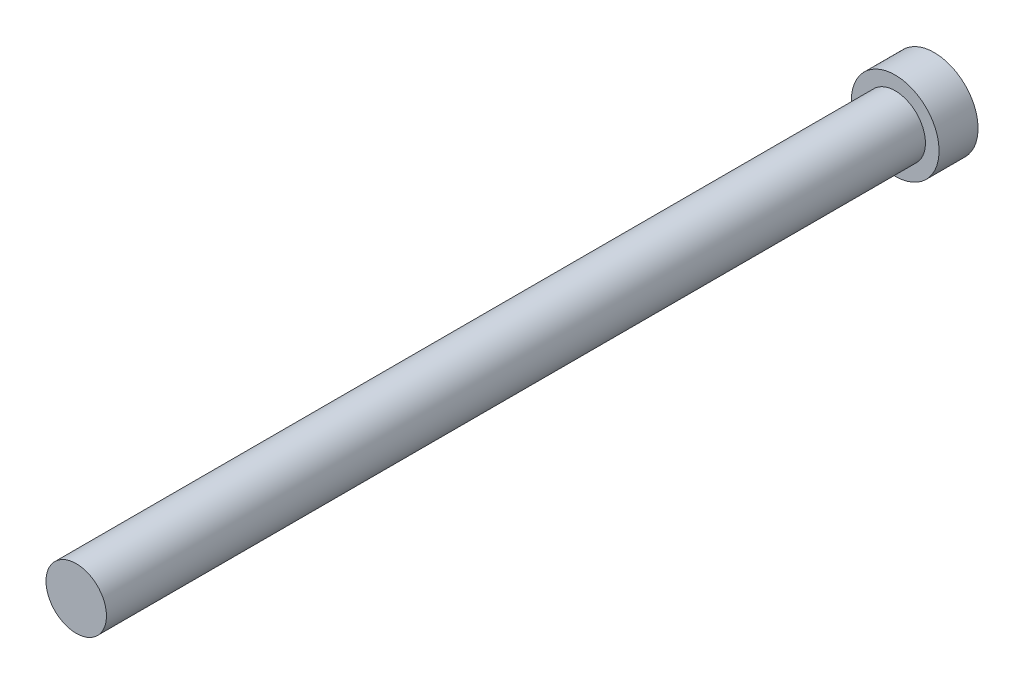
ISO-10303-21;
HEADER;
FILE_DESCRIPTION(('STEP AP214'),'2;1');
FILE_NAME('part.step','',(''),(''),'','','');
FILE_SCHEMA(('AUTOMOTIVE_DESIGN { 1 0 10303 214 1 1 1 1 }'));
ENDSEC;
DATA;
#1=APPLICATION_CONTEXT('core data for automotive mechanical design processes');
#2=APPLICATION_PROTOCOL_DEFINITION('international standard','automotive_design',2000,#1);
#3=PRODUCT_CONTEXT('',#1,'mechanical');
#4=PRODUCT('Part','Part','',(#3));
#5=PRODUCT_RELATED_PRODUCT_CATEGORY('part','',(#4));
#6=PRODUCT_DEFINITION_FORMATION('','',#4);
#7=PRODUCT_DEFINITION_CONTEXT('part definition',#1,'design');
#8=PRODUCT_DEFINITION('design','',#6,#7);
#9=PRODUCT_DEFINITION_SHAPE('','',#8);
#10=(LENGTH_UNIT() NAMED_UNIT(*) SI_UNIT(.MILLI.,.METRE.));
#11=(NAMED_UNIT(*) PLANE_ANGLE_UNIT() SI_UNIT($,.RADIAN.));
#12=(NAMED_UNIT(*) SI_UNIT($,.STERADIAN.) SOLID_ANGLE_UNIT());
#13=UNCERTAINTY_MEASURE_WITH_UNIT(LENGTH_MEASURE(1.E-05),#10,'distance_accuracy_value','');
#14=(GEOMETRIC_REPRESENTATION_CONTEXT(3) GLOBAL_UNCERTAINTY_ASSIGNED_CONTEXT((#13)) GLOBAL_UNIT_ASSIGNED_CONTEXT((#10,
#11,#12)) REPRESENTATION_CONTEXT('',''));
#15=CARTESIAN_POINT('',(0.,0.,0.));
#16=DIRECTION('',(0.,0.,1.));
#17=DIRECTION('',(1.,0.,0.));
#18=AXIS2_PLACEMENT_3D('',#15,#16,#17);
#19=CARTESIAN_POINT('',(0.,0.,88.));
#20=DIRECTION('',(0.,0.,-1.));
#21=DIRECTION('',(-1.,0.,0.));
#22=AXIS2_PLACEMENT_3D('',#19,#20,#21);
#23=CYLINDRICAL_SURFACE('',#22,3.1);
#24=CARTESIAN_POINT('',(0.,0.,88.));
#25=DIRECTION('',(0.,0.,1.));
#26=DIRECTION('',(1.,0.,0.));
#27=AXIS2_PLACEMENT_3D('',#24,#25,#26);
#28=CIRCLE('',#27,3.1);
#29=CARTESIAN_POINT('',(3.1,0.,88.));
#30=VERTEX_POINT('',#29);
#31=EDGE_CURVE('E47',#30,#30,#28,.T.);
#32=ORIENTED_EDGE('',*,*,#31,.F.);
#33=EDGE_LOOP('',(#32));
#34=FACE_BOUND('',#33,.T.);
#35=CARTESIAN_POINT('',(0.,0.,4.));
#36=DIRECTION('',(0.,0.,-1.));
#37=DIRECTION('',(-1.,0.,0.));
#38=AXIS2_PLACEMENT_3D('',#35,#36,#37);
#39=CIRCLE('',#38,3.1);
#40=CARTESIAN_POINT('',(-3.1,0.,4.));
#41=VERTEX_POINT('',#40);
#42=EDGE_CURVE('E12',#41,#41,#39,.T.);
#43=ORIENTED_EDGE('',*,*,#42,.F.);
#44=EDGE_LOOP('',(#43));
#45=FACE_BOUND('',#44,.T.);
#46=ADVANCED_FACE('F41',(#34,#45),#23,.T.);
#47=CARTESIAN_POINT('',(0.,0.,88.));
#48=DIRECTION('',(0.,0.,1.));
#49=DIRECTION('',(1.,0.,0.));
#50=AXIS2_PLACEMENT_3D('',#47,#48,#49);
#51=PLANE('',#50);
#52=ORIENTED_EDGE('',*,*,#31,.T.);
#53=EDGE_LOOP('',(#52));
#54=FACE_BOUND('',#53,.T.);
#55=ADVANCED_FACE('F73',(#54),#51,.T.);
#56=CARTESIAN_POINT('',(0.,0.,4.));
#57=DIRECTION('',(0.,0.,-1.));
#58=DIRECTION('',(-1.,0.,0.));
#59=AXIS2_PLACEMENT_3D('',#56,#57,#58);
#60=PLANE('',#59);
#61=CARTESIAN_POINT('',(0.,0.,4.));
#62=DIRECTION('',(0.,0.,-1.));
#63=DIRECTION('',(-1.,0.,0.));
#64=AXIS2_PLACEMENT_3D('',#61,#62,#63);
#65=CIRCLE('',#64,4.5);
#66=CARTESIAN_POINT('',(-4.5,0.,4.));
#67=VERTEX_POINT('',#66);
#68=EDGE_CURVE('E51',#67,#67,#65,.T.);
#69=ORIENTED_EDGE('',*,*,#68,.F.);
#70=EDGE_LOOP('',(#69));
#71=FACE_BOUND('',#70,.T.);
#72=ORIENTED_EDGE('',*,*,#42,.T.);
#73=EDGE_LOOP('',(#72));
#74=FACE_BOUND('',#73,.T.);
#75=ADVANCED_FACE('F65',(#71,#74),#60,.F.);
#76=CARTESIAN_POINT('',(0.,0.,4.));
#77=DIRECTION('',(0.,0.,-1.));
#78=DIRECTION('',(-1.,0.,0.));
#79=AXIS2_PLACEMENT_3D('',#76,#77,#78);
#80=CYLINDRICAL_SURFACE('',#79,4.5);
#81=ORIENTED_EDGE('',*,*,#68,.T.);
#82=EDGE_LOOP('',(#81));
#83=FACE_BOUND('',#82,.T.);
#84=CARTESIAN_POINT('',(0.,0.,0.));
#85=DIRECTION('',(0.,0.,-1.));
#86=DIRECTION('',(-1.,0.,0.));
#87=AXIS2_PLACEMENT_3D('',#84,#85,#86);
#88=CIRCLE('',#87,4.5);
#89=CARTESIAN_POINT('',(-4.5,0.,0.));
#90=VERTEX_POINT('',#89);
#91=EDGE_CURVE('E55',#90,#90,#88,.T.);
#92=ORIENTED_EDGE('',*,*,#91,.F.);
#93=EDGE_LOOP('',(#92));
#94=FACE_BOUND('',#93,.T.);
#95=ADVANCED_FACE('F63',(#83,#94),#80,.T.);
#96=CARTESIAN_POINT('',(0.,0.,0.));
#97=DIRECTION('',(0.,0.,1.));
#98=DIRECTION('',(1.,0.,0.));
#99=AXIS2_PLACEMENT_3D('',#96,#97,#98);
#100=PLANE('',#99);
#101=ORIENTED_EDGE('',*,*,#91,.T.);
#102=EDGE_LOOP('',(#101));
#103=FACE_BOUND('',#102,.T.);
#104=ADVANCED_FACE('F61',(#103),#100,.F.);
#105=CLOSED_SHELL('',(#46,#55,#75,#95,#104));
#106=MANIFOLD_SOLID_BREP('B2',#105);
#107=ADVANCED_BREP_SHAPE_REPRESENTATION('',(#18,#106),#14);
#108=SHAPE_DEFINITION_REPRESENTATION(#9,#107);
ENDSEC;
END-ISO-10303-21;
